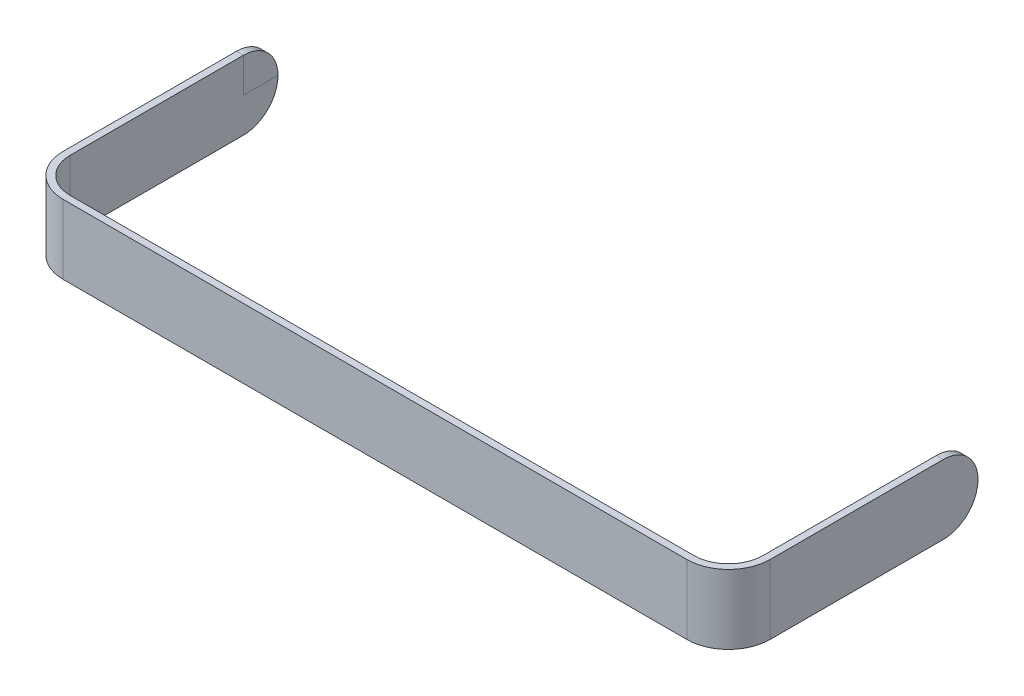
from build123d import *

# Parameters (mm, degrees)
EXTRUDE1_DEPTH = 50
EXTRUDE2_START = -10
EXTRUDE2_DEPTH = 10
EXTRUDE3_DEPTH = 10


with BuildPart() as part:
    # Sketch6 → Extrude1 (new, symmetric)
    with BuildSketch(Plane(origin=(0, 0, 0), x_dir=(1, 0, 0), z_dir=(0, 1, 0))):
        with BuildLine():
            Line((-450, 0), (450, 0))
            ThreePointArc((450, 0), (485.355339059, 14.644660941), (500, 50))
            Line((500, 50), (500, 300))
            Line((500, 300), (510, 300))
            Line((510, 300), (510, 50))
            ThreePointArc((510, 50), (492.426406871, 7.573593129), (450, -10))
            Line((450, -10), (-450, -10))
            ThreePointArc((-450, -10), (-492.426406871, 7.573593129), (-510, 50))
            Line((-510, 50), (-510, 300))
            Line((-510, 300), (-500, 300))
            Line((-500, 300), (-500, 50))
            ThreePointArc((-500, 50), (-485.355339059, 14.644660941), (-450, 0))
        make_face()
    extrude(amount=EXTRUDE1_DEPTH, both=True)

    # Sketch9 → Extrude2 (add)
    with BuildSketch(Plane(origin=(-500, 0, 0), x_dir=(0, 0, -1), z_dir=(1, 0, 0)).offset(EXTRUDE2_START)):
        with BuildLine():
            Line((300, 50), (300, -50))
            ThreePointArc((300, -50), (350, 0), (300, 50))
        make_face()
    extrude(amount=EXTRUDE2_DEPTH)

    # Sketch10 → Extrude3 (add)
    with BuildSketch(Plane.ZY.offset(-500)):
        with BuildLine():
            Line((-300, 50), (-300, -50))
            ThreePointArc((-300, -50), (-350, 0), (-300, 50))
        make_face()
    extrude(amount=-EXTRUDE3_DEPTH)


solid = part.part
